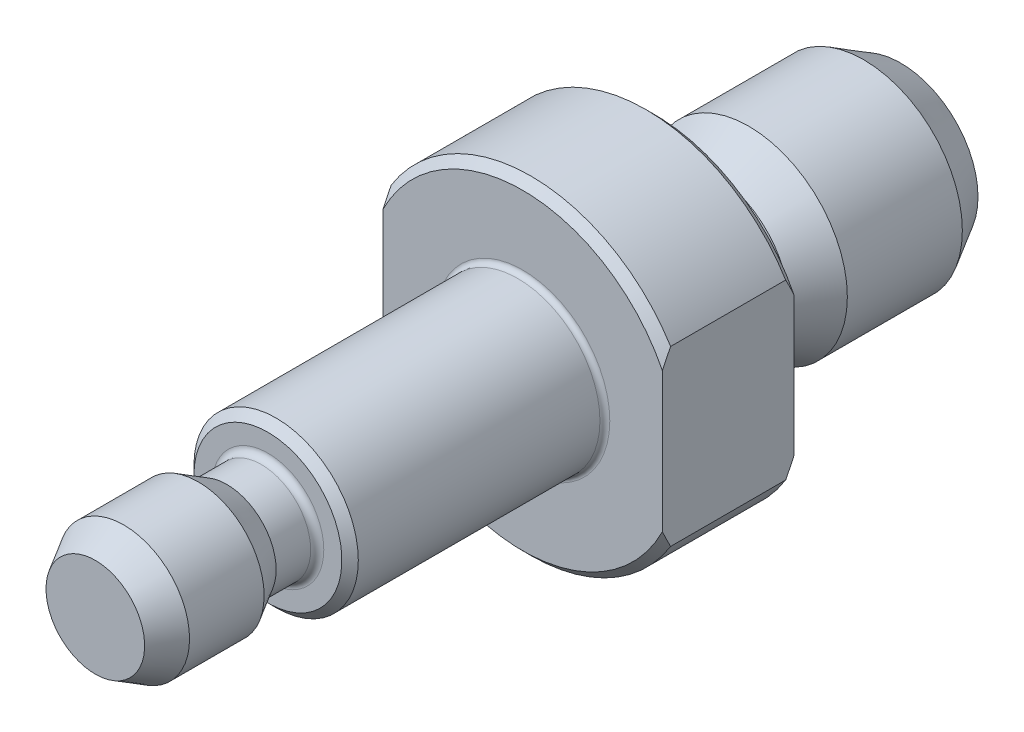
ISO-10303-21;
HEADER;
FILE_DESCRIPTION(('STEP AP214'),'2;1');
FILE_NAME('part.step','',(''),(''),'','','');
FILE_SCHEMA(('AUTOMOTIVE_DESIGN { 1 0 10303 214 1 1 1 1 }'));
ENDSEC;
DATA;
#1=APPLICATION_CONTEXT('core data for automotive mechanical design processes');
#2=APPLICATION_PROTOCOL_DEFINITION('international standard','automotive_design',2000,#1);
#3=PRODUCT_CONTEXT('',#1,'mechanical');
#4=PRODUCT('Part','Part','',(#3));
#5=PRODUCT_RELATED_PRODUCT_CATEGORY('part','',(#4));
#6=PRODUCT_DEFINITION_FORMATION('','',#4);
#7=PRODUCT_DEFINITION_CONTEXT('part definition',#1,'design');
#8=PRODUCT_DEFINITION('design','',#6,#7);
#9=PRODUCT_DEFINITION_SHAPE('','',#8);
#10=(LENGTH_UNIT() NAMED_UNIT(*) SI_UNIT(.MILLI.,.METRE.));
#11=(NAMED_UNIT(*) PLANE_ANGLE_UNIT() SI_UNIT($,.RADIAN.));
#12=(NAMED_UNIT(*) SI_UNIT($,.STERADIAN.) SOLID_ANGLE_UNIT());
#13=UNCERTAINTY_MEASURE_WITH_UNIT(LENGTH_MEASURE(1.E-05),#10,'distance_accuracy_value','');
#14=(GEOMETRIC_REPRESENTATION_CONTEXT(3) GLOBAL_UNCERTAINTY_ASSIGNED_CONTEXT((#13)) GLOBAL_UNIT_ASSIGNED_CONTEXT((#10,
#11,#12)) REPRESENTATION_CONTEXT('',''));
#15=CARTESIAN_POINT('',(0.,0.,0.));
#16=DIRECTION('',(0.,0.,1.));
#17=DIRECTION('',(1.,0.,0.));
#18=AXIS2_PLACEMENT_3D('',#15,#16,#17);
#19=CARTESIAN_POINT('',(0.,0.,0.));
#20=DIRECTION('',(0.,3.37957588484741E-11,1.));
#21=DIRECTION('',(1.,0.,0.));
#22=AXIS2_PLACEMENT_3D('',#19,#20,#21);
#23=CONICAL_SURFACE('',#22,9.5,0.785398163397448);
#24=CARTESIAN_POINT('',(8.5,-5.26782687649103,0.500000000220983));
#25=CARTESIAN_POINT('',(8.5,-5.18370592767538,0.455687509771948));
#26=CARTESIAN_POINT('',(8.5,-5.09926830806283,0.411973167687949));
#27=CARTESIAN_POINT('',(8.5,-4.92976096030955,0.325844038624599));
#28=CARTESIAN_POINT('',(8.5,-4.84469140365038,0.283428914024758));
#29=CARTESIAN_POINT('',(8.5,-4.67387549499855,0.199977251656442));
#30=CARTESIAN_POINT('',(8.5,-4.58812912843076,0.158940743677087));
#31=CARTESIAN_POINT('',(8.5,-4.41592077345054,0.0783385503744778));
#32=CARTESIAN_POINT('',(8.5,-4.32945860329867,0.0387732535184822));
#33=CARTESIAN_POINT('',(8.5,-4.24264068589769,-4.02164412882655E-10));
#34=B_SPLINE_CURVE_WITH_KNOTS('',3,(#24,#25,#26,#27,#28,#29,#30,#31,#32,#33),.UNSPECIFIED.,.F.,
.F.,(4,2,2,2,4),(0.,0.285235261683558,0.570395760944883,0.855562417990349,1.14080384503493),.UNSPECIFIED.);
#35=CARTESIAN_POINT('',(8.5,-5.26782687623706,0.500000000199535));
#36=VERTEX_POINT('',#35);
#37=CARTESIAN_POINT('',(8.5,-4.24264068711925,1.43385303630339E-10));
#38=VERTEX_POINT('',#37);
#39=EDGE_CURVE('E110',#36,#38,#34,.T.);
#40=ORIENTED_EDGE('',*,*,#39,.F.);
#41=CARTESIAN_POINT('',(0.,1.68978794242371E-11,0.5));
#42=DIRECTION('',(0.,3.37957588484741E-11,1.));
#43=DIRECTION('',(1.,0.,0.));
#44=AXIS2_PLACEMENT_3D('',#41,#42,#43);
#45=CIRCLE('',#44,10.);
#46=CARTESIAN_POINT('',(-8.5,-5.26782687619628,0.500000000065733));
#47=VERTEX_POINT('',#46);
#48=EDGE_CURVE('E95',#47,#36,#45,.T.);
#49=ORIENTED_EDGE('',*,*,#48,.F.);
#50=CARTESIAN_POINT('',(-8.5,-4.24264068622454,-2.56211718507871E-10));
#51=CARTESIAN_POINT('',(-8.5,-4.32945860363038,0.0387732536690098));
#52=CARTESIAN_POINT('',(-8.5,-4.41592077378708,0.0783385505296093));
#53=CARTESIAN_POINT('',(-8.5,-4.58812912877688,0.158940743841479));
#54=CARTESIAN_POINT('',(-8.5,-4.67387549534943,0.199977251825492));
#55=CARTESIAN_POINT('',(-8.5,-4.84469140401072,0.283428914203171));
#56=CARTESIAN_POINT('',(-8.5,-4.92976096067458,0.325844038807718));
#57=CARTESIAN_POINT('',(-8.5,-5.09926830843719,0.411973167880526));
#58=CARTESIAN_POINT('',(-8.5,-5.18370592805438,0.455687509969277));
#59=CARTESIAN_POINT('',(-8.5,-5.26782687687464,0.500000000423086));
#60=B_SPLINE_CURVE_WITH_KNOTS('',3,(#50,#51,#52,#53,#54,#55,#56,#57,#58,#59),.UNSPECIFIED.,.F.,
.F.,(4,2,2,2,4),(0.,0.285241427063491,0.570408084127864,0.855568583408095,1.14080384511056),.UNSPECIFIED.);
#61=CARTESIAN_POINT('',(-8.5,-4.24264068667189,-5.64132074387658E-11));
#62=VERTEX_POINT('',#61);
#63=EDGE_CURVE('E81',#62,#47,#60,.T.);
#64=ORIENTED_EDGE('',*,*,#63,.F.);
#65=CARTESIAN_POINT('',(0.,0.,0.));
#66=DIRECTION('',(0.,3.37957588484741E-11,1.));
#67=DIRECTION('',(1.,0.,0.));
#68=AXIS2_PLACEMENT_3D('',#65,#66,#67);
#69=CIRCLE('',#68,9.5);
#70=EDGE_CURVE('E92',#62,#38,#69,.T.);
#71=ORIENTED_EDGE('',*,*,#70,.T.);
#72=EDGE_LOOP('',(#40,#49,#64,#71));
#73=FACE_BOUND('',#72,.T.);
#74=ADVANCED_FACE('F14',(#73),#23,.T.);
#75=CARTESIAN_POINT('',(0.,1.68978794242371E-11,0.5));
#76=DIRECTION('',(0.,3.37957588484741E-11,1.));
#77=DIRECTION('',(1.,0.,0.));
#78=AXIS2_PLACEMENT_3D('',#75,#76,#77);
#79=CYLINDRICAL_SURFACE('',#78,10.);
#80=DIRECTION('',(0.,-3.37957588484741E-11,-1.));
#81=VECTOR('',#80,1.);
#82=CARTESIAN_POINT('',(8.5,-5.26782687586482,4.00000000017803));
#83=LINE('',#82,#81);
#84=CARTESIAN_POINT('',(8.49999999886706,-5.26782687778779,7.50000000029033));
#85=VERTEX_POINT('',#84);
#86=EDGE_CURVE('E148',#85,#36,#83,.T.);
#87=ORIENTED_EDGE('',*,*,#86,.F.);
#88=CARTESIAN_POINT('',(0.,2.53468191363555E-10,7.5));
#89=DIRECTION('',(0.,-3.37957588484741E-11,-1.));
#90=DIRECTION('',(-1.,0.,0.));
#91=AXIS2_PLACEMENT_3D('',#88,#89,#90);
#92=CIRCLE('',#91,10.);
#93=CARTESIAN_POINT('',(-8.5,-5.26782687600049,7.50000000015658));
#94=VERTEX_POINT('',#93);
#95=EDGE_CURVE('E207',#94,#85,#92,.F.);
#96=ORIENTED_EDGE('',*,*,#95,.F.);
#97=DIRECTION('',(0.,3.37957588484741E-11,1.));
#98=VECTOR('',#97,1.);
#99=CARTESIAN_POINT('',(-8.5,-5.26782687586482,4.00000000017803));
#100=LINE('',#99,#98);
#101=EDGE_CURVE('E97',#47,#94,#100,.T.);
#102=ORIENTED_EDGE('',*,*,#101,.F.);
#103=ORIENTED_EDGE('',*,*,#48,.T.);
#104=EDGE_LOOP('',(#87,#96,#102,#103));
#105=FACE_BOUND('',#104,.T.);
#106=ADVANCED_FACE('F243',(#105),#79,.T.);
#107=CARTESIAN_POINT('',(0.,1.68978794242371E-11,0.5));
#108=DIRECTION('',(0.,3.37957588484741E-11,1.));
#109=DIRECTION('',(1.,0.,0.));
#110=AXIS2_PLACEMENT_3D('',#107,#108,#109);
#111=CYLINDRICAL_SURFACE('',#110,10.);
#112=DIRECTION('',(0.,3.37957588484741E-11,1.));
#113=VECTOR('',#112,1.);
#114=CARTESIAN_POINT('',(8.5,5.26782687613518,3.99999999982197));
#115=LINE('',#114,#113);
#116=CARTESIAN_POINT('',(8.5,5.26782687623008,0.499999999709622));
#117=VERTEX_POINT('',#116);
#118=CARTESIAN_POINT('',(8.5,5.26782687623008,7.50000000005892));
#119=VERTEX_POINT('',#118);
#120=EDGE_CURVE('E149',#117,#119,#115,.T.);
#121=ORIENTED_EDGE('',*,*,#120,.F.);
#122=CARTESIAN_POINT('',(0.,1.68978794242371E-11,0.5));
#123=DIRECTION('',(0.,3.37957588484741E-11,1.));
#124=DIRECTION('',(1.,0.,0.));
#125=AXIS2_PLACEMENT_3D('',#122,#123,#124);
#126=CIRCLE('',#125,10.);
#127=CARTESIAN_POINT('',(-8.5,5.26782687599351,0.49999999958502));
#128=VERTEX_POINT('',#127);
#129=EDGE_CURVE('E105',#128,#117,#126,.F.);
#130=ORIENTED_EDGE('',*,*,#129,.F.);
#131=DIRECTION('',(0.,-3.37957588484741E-11,-1.));
#132=VECTOR('',#131,1.);
#133=CARTESIAN_POINT('',(-8.5,5.26782687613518,3.99999999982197));
#134=LINE('',#133,#132);
#135=CARTESIAN_POINT('',(-8.5,5.26782687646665,7.49999999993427));
#136=VERTEX_POINT('',#135);
#137=EDGE_CURVE('E173',#136,#128,#134,.T.);
#138=ORIENTED_EDGE('',*,*,#137,.F.);
#139=CARTESIAN_POINT('',(0.,2.53468191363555E-10,7.5));
#140=DIRECTION('',(0.,-3.37957588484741E-11,-1.));
#141=DIRECTION('',(-1.,0.,0.));
#142=AXIS2_PLACEMENT_3D('',#139,#140,#141);
#143=CIRCLE('',#142,10.);
#144=EDGE_CURVE('E106',#119,#136,#143,.F.);
#145=ORIENTED_EDGE('',*,*,#144,.F.);
#146=EDGE_LOOP('',(#121,#130,#138,#145));
#147=FACE_BOUND('',#146,.T.);
#148=ADVANCED_FACE('F317',(#147),#111,.T.);
#149=CARTESIAN_POINT('',(0.,0.,0.));
#150=DIRECTION('',(0.,3.37957588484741E-11,1.));
#151=DIRECTION('',(1.,0.,0.));
#152=AXIS2_PLACEMENT_3D('',#149,#150,#151);
#153=CONICAL_SURFACE('',#152,9.5,0.785398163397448);
#154=CARTESIAN_POINT('',(8.49999999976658,4.242640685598,-7.01536051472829E-10));
#155=CARTESIAN_POINT('',(8.49999999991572,4.32945860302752,0.038773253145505));
#156=CARTESIAN_POINT('',(8.49999999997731,4.41592077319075,0.0783385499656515));
#157=CARTESIAN_POINT('',(8.50000000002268,4.58812912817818,0.158940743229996));
#158=CARTESIAN_POINT('',(8.50000000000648,4.67387549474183,0.199977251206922));
#159=CARTESIAN_POINT('',(8.49999999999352,4.84469140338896,0.2834289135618));
#160=CARTESIAN_POINT('',(8.49999999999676,4.92976096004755,0.325844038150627));
#161=CARTESIAN_POINT('',(8.50000000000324,5.09926830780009,0.411973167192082));
#162=CARTESIAN_POINT('',(8.50000000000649,5.18370592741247,0.455687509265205));
#163=CARTESIAN_POINT('',(8.5,5.2678268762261,0.499999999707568));
#164=B_SPLINE_CURVE_WITH_KNOTS('',3,(#154,#155,#156,#157,#158,#159,#160,#161,#162,#163),
.UNSPECIFIED.,.F.,.F.,(4,2,2,2,4),(0.,0.285241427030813,0.570408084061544,0.855568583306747,
1.14080384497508),.UNSPECIFIED.);
#165=CARTESIAN_POINT('',(8.5,4.24264068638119,-4.73038275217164E-10));
#166=VERTEX_POINT('',#165);
#167=EDGE_CURVE('E118',#166,#117,#164,.T.);
#168=ORIENTED_EDGE('',*,*,#167,.F.);
#169=CARTESIAN_POINT('',(0.,0.,0.));
#170=DIRECTION('',(0.,3.37957588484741E-11,1.));
#171=DIRECTION('',(1.,0.,0.));
#172=AXIS2_PLACEMENT_3D('',#169,#170,#171);
#173=CIRCLE('',#172,9.5);
#174=CARTESIAN_POINT('',(-8.5,4.24264068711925,-1.43385303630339E-10));
#175=VERTEX_POINT('',#174);
#176=EDGE_CURVE('E104',#166,#175,#173,.T.);
#177=ORIENTED_EDGE('',*,*,#176,.T.);
#178=CARTESIAN_POINT('',(-8.50000000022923,5.26782687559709,0.499999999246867));
#179=CARTESIAN_POINT('',(-8.50000000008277,5.18370592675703,0.455687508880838));
#180=CARTESIAN_POINT('',(-8.50000000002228,5.09926830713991,0.411973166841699));
#181=CARTESIAN_POINT('',(-8.49999999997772,4.929760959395,0.325844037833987));
#182=CARTESIAN_POINT('',(-8.49999999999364,4.84469140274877,0.283428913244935));
#183=CARTESIAN_POINT('',(-8.50000000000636,4.67387549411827,0.199977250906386));
#184=CARTESIAN_POINT('',(-8.50000000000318,4.58812912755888,0.158940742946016));
#185=CARTESIAN_POINT('',(-8.49999999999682,4.41592077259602,0.0783385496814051));
#186=CARTESIAN_POINT('',(-8.49999999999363,4.32945860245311,0.0387732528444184));
#187=CARTESIAN_POINT('',(-8.5,4.24264068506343,-1.06153280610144E-09));
#188=B_SPLINE_CURVE_WITH_KNOTS('',3,(#178,#179,#180,#181,#182,#183,#184,#185,#186,#187),
.UNSPECIFIED.,.F.,.F.,(4,2,2,2,4),(0.,0.285235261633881,0.570395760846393,0.855562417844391,
1.14080384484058),.UNSPECIFIED.);
#189=EDGE_CURVE('E84',#128,#175,#188,.T.);
#190=ORIENTED_EDGE('',*,*,#189,.F.);
#191=ORIENTED_EDGE('',*,*,#129,.T.);
#192=EDGE_LOOP('',(#168,#177,#190,#191));
#193=FACE_BOUND('',#192,.T.);
#194=ADVANCED_FACE('F159',(#193),#153,.T.);
#195=CARTESIAN_POINT('',(-8.5,-9.690384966,3.2749497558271E-10));
#196=DIRECTION('',(0.,3.37957588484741E-11,1.));
#197=DIRECTION('',(1.,0.,0.));
#198=AXIS2_PLACEMENT_3D('',#195,#196,#197);
#199=PLANE('',#198);
#200=ORIENTED_EDGE('',*,*,#70,.F.);
#201=DIRECTION('',(0.,-1.,3.37957588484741E-11));
#202=VECTOR('',#201,1.);
#203=CARTESIAN_POINT('',(-8.5,0.,0.));
#204=LINE('',#203,#202);
#205=EDGE_CURVE('E77',#175,#62,#204,.T.);
#206=ORIENTED_EDGE('',*,*,#205,.F.);
#207=ORIENTED_EDGE('',*,*,#176,.F.);
#208=DIRECTION('',(0.,1.,-3.37957588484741E-11));
#209=VECTOR('',#208,1.);
#210=CARTESIAN_POINT('',(8.5,0.,0.));
#211=LINE('',#210,#209);
#212=EDGE_CURVE('E102',#38,#166,#211,.T.);
#213=ORIENTED_EDGE('',*,*,#212,.F.);
#214=EDGE_LOOP('',(#200,#206,#207,#213));
#215=FACE_BOUND('',#214,.T.);
#216=CARTESIAN_POINT('',(0.,0.,3.21060018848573E-10));
#217=DIRECTION('',(0.,0.,1.));
#218=DIRECTION('',(1.,0.,0.));
#219=AXIS2_PLACEMENT_3D('',#216,#217,#218);
#220=CIRCLE('',#219,5.1);
#221=CARTESIAN_POINT('',(5.1,0.,3.21060018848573E-10));
#222=VERTEX_POINT('',#221);
#223=EDGE_CURVE('E293',#222,#222,#220,.T.);
#224=ORIENTED_EDGE('',*,*,#223,.T.);
#225=EDGE_LOOP('',(#224));
#226=FACE_BOUND('',#225,.T.);
#227=ADVANCED_FACE('F100',(#215,#226),#199,.F.);
#228=CARTESIAN_POINT('',(0.,2.70366070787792E-10,8.));
#229=DIRECTION('',(0.,-3.37955762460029E-11,-1.));
#230=DIRECTION('',(0.,1.,-3.37955762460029E-11));
#231=AXIS2_PLACEMENT_3D('',#228,#229,#230);
#232=CONICAL_SURFACE('',#231,9.5,0.785398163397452);
#233=CARTESIAN_POINT('',(8.50000000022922,5.26782687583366,7.50000000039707));
#234=CARTESIAN_POINT('',(8.50000000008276,5.18370592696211,7.54431249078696));
#235=CARTESIAN_POINT('',(8.50000000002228,5.09926830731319,7.58802683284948));
#236=CARTESIAN_POINT('',(8.49999999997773,4.92976095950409,7.6741559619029));
#237=CARTESIAN_POINT('',(8.49999999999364,4.84469140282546,7.71657108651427));
#238=CARTESIAN_POINT('',(8.50000000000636,4.67387549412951,7.80002274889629));
#239=CARTESIAN_POINT('',(8.50000000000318,4.58812912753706,7.84105925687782));
#240=CARTESIAN_POINT('',(8.49999999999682,4.41592077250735,7.92166145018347));
#241=CARTESIAN_POINT('',(8.49999999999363,4.32945860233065,7.96122674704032));
#242=CARTESIAN_POINT('',(8.5,4.24264068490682,8.00000000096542));
#243=B_SPLINE_CURVE_WITH_KNOTS('',3,(#233,#234,#235,#236,#237,#238,#239,#240,#241,#242),
.UNSPECIFIED.,.F.,.F.,(4,2,2,2,4),(0.,0.285235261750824,0.570395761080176,0.855562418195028,
1.14080384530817),.UNSPECIFIED.);
#244=CARTESIAN_POINT('',(8.5,4.24264068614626,8.00000000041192));
#245=VERTEX_POINT('',#244);
#246=EDGE_CURVE('E141',#119,#245,#243,.T.);
#247=ORIENTED_EDGE('',*,*,#246,.F.);
#248=ORIENTED_EDGE('',*,*,#144,.T.);
#249=CARTESIAN_POINT('',(-8.49999999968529,4.24264068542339,8.00000000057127));
#250=CARTESIAN_POINT('',(-8.49999999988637,4.32945860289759,7.96122674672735));
#251=CARTESIAN_POINT('',(-8.49999999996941,4.41592077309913,7.92166144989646));
#252=CARTESIAN_POINT('',(-8.50000000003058,4.588129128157,7.84105925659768));
#253=CARTESIAN_POINT('',(-8.50000000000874,4.67387549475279,7.80002274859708));
#254=CARTESIAN_POINT('',(-8.49999999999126,4.84469140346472,7.71657108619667));
#255=CARTESIAN_POINT('',(-8.49999999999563,4.92976096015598,7.67415596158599));
#256=CARTESIAN_POINT('',(-8.50000000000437,5.09926830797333,7.58802683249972));
#257=CARTESIAN_POINT('',(-8.50000000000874,5.18370592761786,7.54431249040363));
#258=CARTESIAN_POINT('',(-8.5,5.26782687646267,7.49999999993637));
#259=B_SPLINE_CURVE_WITH_KNOTS('',3,(#249,#250,#251,#252,#253,#254,#255,#256,#257,#258),
.UNSPECIFIED.,.F.,.F.,(4,2,2,2,4),(0.,0.285241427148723,0.570408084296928,0.855568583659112,
1.14080384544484),.UNSPECIFIED.);
#260=CARTESIAN_POINT('',(-8.5,4.24264068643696,8.00000000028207));
#261=VERTEX_POINT('',#260);
#262=EDGE_CURVE('E166',#261,#136,#259,.T.);
#263=ORIENTED_EDGE('',*,*,#262,.F.);
#264=CARTESIAN_POINT('',(0.,2.70366070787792E-10,8.));
#265=DIRECTION('',(0.,-3.37955762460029E-11,-1.));
#266=DIRECTION('',(0.,1.,-3.37955762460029E-11));
#267=AXIS2_PLACEMENT_3D('',#264,#265,#266);
#268=CIRCLE('',#267,9.5);
#269=EDGE_CURVE('E88',#261,#245,#268,.T.);
#270=ORIENTED_EDGE('',*,*,#269,.T.);
#271=EDGE_LOOP('',(#247,#248,#263,#270));
#272=FACE_BOUND('',#271,.T.);
#273=ADVANCED_FACE('F134',(#272),#232,.T.);
#274=CARTESIAN_POINT('',(8.5,-5.26782687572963,8.00000000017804));
#275=DIRECTION('',(1.,0.,0.));
#276=DIRECTION('',(0.,-3.37957588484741E-11,-1.));
#277=AXIS2_PLACEMENT_3D('',#274,#275,#276);
#278=PLANE('',#277);
#279=CARTESIAN_POINT('',(8.49999999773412,-5.26782687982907,7.50000000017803));
#280=CARTESIAN_POINT('',(8.50000020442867,-5.22460481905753,7.52276838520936));
#281=CARTESIAN_POINT('',(8.50000028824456,-5.18129928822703,7.54537852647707));
#282=CARTESIAN_POINT('',(8.50000031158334,-5.09486871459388,7.59008903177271));
#283=CARTESIAN_POINT('',(8.50000025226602,-5.0517450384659,7.61219203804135));
#284=CARTESIAN_POINT('',(8.50000009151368,-4.96567179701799,7.6558883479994));
#285=CARTESIAN_POINT('',(8.49999999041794,-4.92272358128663,7.67748430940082));
#286=CARTESIAN_POINT('',(8.49999982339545,-4.83699468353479,7.72016648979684));
#287=CARTESIAN_POINT('',(8.49999975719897,-4.79421533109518,7.74125537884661));
#288=CARTESIAN_POINT('',(8.4999997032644,-4.70881735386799,7.78292341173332));
#289=CARTESIAN_POINT('',(8.49999971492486,-4.6662000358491,7.80350523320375));
#290=CARTESIAN_POINT('',(8.49999981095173,-4.58111910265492,7.84415911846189));
#291=CARTESIAN_POINT('',(8.49999989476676,-4.53865676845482,7.8642338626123));
#292=CARTESIAN_POINT('',(8.5000000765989,-4.45387853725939,7.90387361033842));
#293=CARTESIAN_POINT('',(8.500000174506,-4.41156389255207,7.92344129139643));
#294=CARTESIAN_POINT('',(8.50000022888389,-4.32707360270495,7.9620668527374));
#295=CARTESIAN_POINT('',(8.50000018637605,-4.28489917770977,7.9811274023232));
#296=CARTESIAN_POINT('',(8.49999999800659,-4.24264069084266,8.00000000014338));
#297=B_SPLINE_CURVE_WITH_KNOTS('',3,(#279,#280,#281,#282,#283,#284,#285,#286,#287,#288,#289,
#290,#291,#292,#293,#294,#295,#296),.UNSPECIFIED.,.F.,.F.,(4,2,2,2,2,2,2,2,4),(0.,
0.146556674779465,0.291929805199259,0.436144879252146,0.579228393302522,0.721207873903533,
0.86211189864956,1.00197011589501,1.14081326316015),.UNSPECIFIED.);
#298=CARTESIAN_POINT('',(8.4999999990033,-4.24264068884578,8.00000000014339));
#299=VERTEX_POINT('',#298);
#300=EDGE_CURVE('E98',#85,#299,#297,.T.);
#301=ORIENTED_EDGE('',*,*,#300,.F.);
#302=ORIENTED_EDGE('',*,*,#86,.T.);
#303=ORIENTED_EDGE('',*,*,#39,.T.);
#304=ORIENTED_EDGE('',*,*,#212,.T.);
#305=ORIENTED_EDGE('',*,*,#167,.T.);
#306=ORIENTED_EDGE('',*,*,#120,.T.);
#307=ORIENTED_EDGE('',*,*,#246,.T.);
#308=DIRECTION('',(0.,-1.,3.37957588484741E-11));
#309=VECTOR('',#308,1.);
#310=CARTESIAN_POINT('',(8.5,2.70366070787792E-10,8.));
#311=LINE('',#310,#309);
#312=EDGE_CURVE('E192',#245,#299,#311,.T.);
#313=ORIENTED_EDGE('',*,*,#312,.T.);
#314=EDGE_LOOP('',(#301,#302,#303,#304,#305,#306,#307,#313));
#315=FACE_BOUND('',#314,.T.);
#316=ADVANCED_FACE('F128',(#315),#278,.T.);
#317=CARTESIAN_POINT('',(0.,2.70366070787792E-10,8.));
#318=DIRECTION('',(0.,-3.37955762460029E-11,-1.));
#319=DIRECTION('',(0.,1.,-3.37955762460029E-11));
#320=AXIS2_PLACEMENT_3D('',#317,#318,#319);
#321=CONICAL_SURFACE('',#320,9.5,0.785398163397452);
#322=ORIENTED_EDGE('',*,*,#300,.T.);
#323=CARTESIAN_POINT('',(0.,2.70366070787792E-10,8.));
#324=DIRECTION('',(0.,-3.37955762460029E-11,-1.));
#325=DIRECTION('',(0.,1.,-3.37955762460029E-11));
#326=AXIS2_PLACEMENT_3D('',#323,#324,#325);
#327=CIRCLE('',#326,9.5);
#328=CARTESIAN_POINT('',(-8.5,-4.24264068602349,8.00000000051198));
#329=VERTEX_POINT('',#328);
#330=EDGE_CURVE('E38',#299,#329,#327,.T.);
#331=ORIENTED_EDGE('',*,*,#330,.T.);
#332=CARTESIAN_POINT('',(-8.5,-5.26782687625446,7.50000000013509));
#333=CARTESIAN_POINT('',(-8.5,-5.18370592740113,7.5443124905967));
#334=CARTESIAN_POINT('',(-8.5,-5.0992683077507,7.58802683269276));
#335=CARTESIAN_POINT('',(-8.5,-4.92976095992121,7.67415596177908));
#336=CARTESIAN_POINT('',(-8.5,-4.84469140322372,7.71657108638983));
#337=CARTESIAN_POINT('',(-8.5,-4.67387549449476,7.8000227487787));
#338=CARTESIAN_POINT('',(-8.5,-4.58812912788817,7.84105925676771));
#339=CARTESIAN_POINT('',(-8.5,-4.41592077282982,7.92166145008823));
#340=CARTESIAN_POINT('',(-8.5,-4.32945860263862,7.96122674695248));
#341=CARTESIAN_POINT('',(-8.5,-4.24264068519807,8.00000000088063));
#342=B_SPLINE_CURVE_WITH_KNOTS('',3,(#332,#333,#334,#335,#336,#337,#338,#339,#340,#341),
.UNSPECIFIED.,.F.,.F.,(4,2,2,2,4),(0.,0.285235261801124,0.570395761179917,0.855562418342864,
1.14080384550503),.UNSPECIFIED.);
#343=EDGE_CURVE('E174',#94,#329,#342,.T.);
#344=ORIENTED_EDGE('',*,*,#343,.F.);
#345=ORIENTED_EDGE('',*,*,#95,.T.);
#346=EDGE_LOOP('',(#322,#331,#344,#345));
#347=FACE_BOUND('',#346,.T.);
#348=ADVANCED_FACE('F133',(#347),#321,.T.);
#349=CARTESIAN_POINT('',(-8.5,-5.267826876,1.78031200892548E-10));
#350=DIRECTION('',(-1.,0.,0.));
#351=DIRECTION('',(0.,3.37957588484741E-11,1.));
#352=AXIS2_PLACEMENT_3D('',#349,#350,#351);
#353=PLANE('',#352);
#354=ORIENTED_EDGE('',*,*,#189,.T.);
#355=ORIENTED_EDGE('',*,*,#205,.T.);
#356=ORIENTED_EDGE('',*,*,#63,.T.);
#357=ORIENTED_EDGE('',*,*,#101,.T.);
#358=ORIENTED_EDGE('',*,*,#343,.T.);
#359=DIRECTION('',(0.,1.,-3.37957588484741E-11));
#360=VECTOR('',#359,1.);
#361=CARTESIAN_POINT('',(-8.5,2.70366070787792E-10,8.));
#362=LINE('',#361,#360);
#363=EDGE_CURVE('E189',#329,#261,#362,.T.);
#364=ORIENTED_EDGE('',*,*,#363,.T.);
#365=ORIENTED_EDGE('',*,*,#262,.T.);
#366=ORIENTED_EDGE('',*,*,#137,.T.);
#367=EDGE_LOOP('',(#354,#355,#356,#357,#358,#364,#365,#366));
#368=FACE_BOUND('',#367,.T.);
#369=ADVANCED_FACE('F79',(#368),#353,.T.);
#370=CARTESIAN_POINT('',(8.5,-9.69038496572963,8.0000000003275));
#371=DIRECTION('',(0.,-3.37957588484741E-11,-1.));
#372=DIRECTION('',(-1.,0.,0.));
#373=AXIS2_PLACEMENT_3D('',#370,#371,#372);
#374=PLANE('',#373);
#375=CARTESIAN_POINT('',(0.,2.70366070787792E-10,8.));
#376=DIRECTION('',(0.,3.37957588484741E-11,1.));
#377=DIRECTION('',(1.,0.,0.));
#378=AXIS2_PLACEMENT_3D('',#375,#376,#377);
#379=CIRCLE('',#378,5.3);
#380=CARTESIAN_POINT('',(5.3,2.70366070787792E-10,8.));
#381=VERTEX_POINT('',#380);
#382=EDGE_CURVE('E191',#381,#381,#379,.F.);
#383=ORIENTED_EDGE('',*,*,#382,.T.);
#384=EDGE_LOOP('',(#383));
#385=FACE_BOUND('',#384,.T.);
#386=ORIENTED_EDGE('',*,*,#330,.F.);
#387=ORIENTED_EDGE('',*,*,#312,.F.);
#388=ORIENTED_EDGE('',*,*,#269,.F.);
#389=ORIENTED_EDGE('',*,*,#363,.F.);
#390=EDGE_LOOP('',(#386,#387,#388,#389));
#391=FACE_BOUND('',#390,.T.);
#392=ADVANCED_FACE('F235',(#385,#391),#374,.F.);
#393=CARTESIAN_POINT('',(0.,2.80504798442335E-10,8.3));
#394=DIRECTION('',(0.,3.37957588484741E-11,1.));
#395=DIRECTION('',(1.,0.,0.));
#396=AXIS2_PLACEMENT_3D('',#393,#394,#395);
#397=TOROIDAL_SURFACE('',#396,5.3,0.300000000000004);
#398=ORIENTED_EDGE('',*,*,#382,.F.);
#399=EDGE_LOOP('',(#398));
#400=FACE_BOUND('',#399,.T.);
#401=CARTESIAN_POINT('',(0.,2.80504798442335E-10,8.3));
#402=DIRECTION('',(0.,3.37957588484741E-11,1.));
#403=DIRECTION('',(1.,0.,0.));
#404=AXIS2_PLACEMENT_3D('',#401,#402,#403);
#405=CIRCLE('',#404,5.);
#406=CARTESIAN_POINT('',(5.,2.80504798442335E-10,8.3));
#407=VERTEX_POINT('',#406);
#408=EDGE_CURVE('E202',#407,#407,#405,.T.);
#409=ORIENTED_EDGE('',*,*,#408,.F.);
#410=EDGE_LOOP('',(#409));
#411=FACE_BOUND('',#410,.T.);
#412=ADVANCED_FACE('F357',(#400,#411),#397,.F.);
#413=CARTESIAN_POINT('',(0.,2.80504798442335E-10,8.3));
#414=DIRECTION('',(0.,3.37957588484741E-11,1.));
#415=DIRECTION('',(1.,0.,0.));
#416=AXIS2_PLACEMENT_3D('',#413,#414,#415);
#417=CYLINDRICAL_SURFACE('',#416,5.);
#418=ORIENTED_EDGE('',*,*,#408,.T.);
#419=EDGE_LOOP('',(#418));
#420=FACE_BOUND('',#419,.T.);
#421=CARTESIAN_POINT('',(0.,7.77302453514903E-10,23.));
#422=DIRECTION('',(0.,-3.37957588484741E-11,-1.));
#423=DIRECTION('',(-1.,0.,0.));
#424=AXIS2_PLACEMENT_3D('',#421,#422,#423);
#425=CIRCLE('',#424,5.);
#426=CARTESIAN_POINT('',(-5.,7.77302453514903E-10,23.));
#427=VERTEX_POINT('',#426);
#428=EDGE_CURVE('E198',#427,#427,#425,.F.);
#429=ORIENTED_EDGE('',*,*,#428,.F.);
#430=EDGE_LOOP('',(#429));
#431=FACE_BOUND('',#430,.T.);
#432=ADVANCED_FACE('F367',(#420,#431),#417,.T.);
#433=CARTESIAN_POINT('',(0.,7.9420033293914E-10,23.5));
#434=DIRECTION('',(0.,-3.37957588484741E-11,-1.));
#435=DIRECTION('',(-1.,0.,0.));
#436=AXIS2_PLACEMENT_3D('',#433,#434,#435);
#437=CONICAL_SURFACE('',#436,4.5,0.785398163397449);
#438=CARTESIAN_POINT('',(0.,7.9420033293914E-10,23.5));
#439=DIRECTION('',(0.,-3.37957588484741E-11,-1.));
#440=DIRECTION('',(-1.,0.,0.));
#441=AXIS2_PLACEMENT_3D('',#438,#439,#440);
#442=CIRCLE('',#441,4.49999999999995);
#443=CARTESIAN_POINT('',(-4.49999999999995,7.9420033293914E-10,23.5));
#444=VERTEX_POINT('',#443);
#445=EDGE_CURVE('E201',#444,#444,#442,.T.);
#446=ORIENTED_EDGE('',*,*,#445,.T.);
#447=EDGE_LOOP('',(#446));
#448=FACE_BOUND('',#447,.T.);
#449=ORIENTED_EDGE('',*,*,#428,.T.);
#450=EDGE_LOOP('',(#449));
#451=FACE_BOUND('',#450,.T.);
#452=ADVANCED_FACE('F268',(#448,#451),#437,.T.);
#453=CARTESIAN_POINT('',(4.554,-4.5696701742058,23.5000000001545));
#454=DIRECTION('',(0.,-3.37957588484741E-11,-1.));
#455=DIRECTION('',(-1.,0.,0.));
#456=AXIS2_PLACEMENT_3D('',#453,#454,#455);
#457=PLANE('',#456);
#458=CARTESIAN_POINT('',(0.,7.9420033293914E-10,23.5));
#459=DIRECTION('',(0.,3.37957588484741E-11,1.));
#460=DIRECTION('',(1.,0.,0.));
#461=AXIS2_PLACEMENT_3D('',#458,#459,#460);
#462=CIRCLE('',#461,3.4);
#463=CARTESIAN_POINT('',(3.4,7.9420033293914E-10,23.5));
#464=VERTEX_POINT('',#463);
#465=EDGE_CURVE('E197',#464,#464,#462,.F.);
#466=ORIENTED_EDGE('',*,*,#465,.T.);
#467=EDGE_LOOP('',(#466));
#468=FACE_BOUND('',#467,.T.);
#469=ORIENTED_EDGE('',*,*,#445,.F.);
#470=EDGE_LOOP('',(#469));
#471=FACE_BOUND('',#470,.T.);
#472=ADVANCED_FACE('F263',(#468,#471),#457,.F.);
#473=CARTESIAN_POINT('',(0.,8.0771863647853E-10,23.9));
#474=DIRECTION('',(0.,3.37957588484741E-11,1.));
#475=DIRECTION('',(1.,0.,0.));
#476=AXIS2_PLACEMENT_3D('',#473,#474,#475);
#477=TOROIDAL_SURFACE('',#476,3.4,0.4);
#478=CARTESIAN_POINT('',(0.,8.0771863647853E-10,23.9));
#479=DIRECTION('',(0.,3.37957588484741E-11,1.));
#480=DIRECTION('',(1.,0.,0.));
#481=AXIS2_PLACEMENT_3D('',#478,#479,#480);
#482=CIRCLE('',#481,3.);
#483=CARTESIAN_POINT('',(3.,8.0771863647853E-10,23.9));
#484=VERTEX_POINT('',#483);
#485=EDGE_CURVE('E194',#484,#484,#482,.T.);
#486=ORIENTED_EDGE('',*,*,#485,.F.);
#487=EDGE_LOOP('',(#486));
#488=FACE_BOUND('',#487,.T.);
#489=ORIENTED_EDGE('',*,*,#465,.F.);
#490=EDGE_LOOP('',(#489));
#491=FACE_BOUND('',#490,.T.);
#492=ADVANCED_FACE('F254',(#488,#491),#477,.F.);
#493=CARTESIAN_POINT('',(0.,8.0771863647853E-10,23.9));
#494=DIRECTION('',(0.,3.37954697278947E-11,1.));
#495=DIRECTION('',(0.,-1.,3.37954697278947E-11));
#496=AXIS2_PLACEMENT_3D('',#493,#494,#495);
#497=CYLINDRICAL_SURFACE('',#496,3.);
#498=CARTESIAN_POINT('',(0.,0.,25.9999999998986));
#499=DIRECTION('',(0.,0.,1.));
#500=DIRECTION('',(1.,0.,0.));
#501=AXIS2_PLACEMENT_3D('',#498,#499,#500);
#502=CIRCLE('',#501,3.00000000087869);
#503=CARTESIAN_POINT('',(3.00000000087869,0.,25.9999999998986));
#504=VERTEX_POINT('',#503);
#505=EDGE_CURVE('E309',#504,#504,#502,.T.);
#506=ORIENTED_EDGE('',*,*,#505,.F.);
#507=EDGE_LOOP('',(#506));
#508=FACE_BOUND('',#507,.T.);
#509=ORIENTED_EDGE('',*,*,#485,.T.);
#510=EDGE_LOOP('',(#509));
#511=FACE_BOUND('',#510,.T.);
#512=ADVANCED_FACE('F251',(#508,#511),#497,.T.);
#513=CARTESIAN_POINT('',(0.,0.,30.5507543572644));
#514=DIRECTION('',(0.,0.,1.));
#515=DIRECTION('',(1.,0.,0.));
#516=AXIS2_PLACEMENT_3D('',#513,#514,#515);
#517=CONICAL_SURFACE('',#516,5.62737925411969,0.523598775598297);
#518=ORIENTED_EDGE('',*,*,#505,.T.);
#519=EDGE_LOOP('',(#518));
#520=FACE_BOUND('',#519,.T.);
#521=CARTESIAN_POINT('',(-2.60316549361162,-3.03702640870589,27.7320508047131));
#522=CARTESIAN_POINT('',(-2.77499153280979,-2.8897332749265,27.7320508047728));
#523=CARTESIAN_POINT('',(-2.93441875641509,-2.72771096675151,27.7320508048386));
#524=CARTESIAN_POINT('',(-3.22370969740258,-2.37889790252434,27.7320508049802));
#525=CARTESIAN_POINT('',(-3.3535366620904,-2.19207680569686,27.732050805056));
#526=CARTESIAN_POINT('',(-3.57885057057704,-1.80066794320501,27.7320508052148));
#527=CARTESIAN_POINT('',(-3.67459484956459,-1.59622844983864,27.7320508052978));
#528=CARTESIAN_POINT('',(-3.83037146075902,-1.17423733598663,27.7320508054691));
#529=CARTESIAN_POINT('',(-3.89041370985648,-0.956689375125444,27.7320508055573));
#530=CARTESIAN_POINT('',(-3.97313393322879,-0.514574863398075,27.7320508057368));
#531=CARTESIAN_POINT('',(-3.99580755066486,-0.290007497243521,27.7320508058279));
#532=CARTESIAN_POINT('',(-4.00313204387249,0.159756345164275,27.7320508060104));
#533=CARTESIAN_POINT('',(-3.98778121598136,0.384952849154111,27.7320508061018));
#534=CARTESIAN_POINT('',(-3.91949014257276,0.829567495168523,27.7320508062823));
#535=CARTESIAN_POINT('',(-3.86655068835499,1.04898575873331,27.7320508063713));
#536=CARTESIAN_POINT('',(-3.72458611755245,1.47581958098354,27.7320508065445));
#537=CARTESIAN_POINT('',(-3.63556109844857,1.68323517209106,27.7320508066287));
#538=CARTESIAN_POINT('',(-3.42395233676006,2.08017685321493,27.7320508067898));
#539=CARTESIAN_POINT('',(-3.30136851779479,2.26970290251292,27.7320508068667));
#540=CARTESIAN_POINT('',(-3.02612229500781,2.62548453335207,27.7320508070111));
#541=CARTESIAN_POINT('',(-2.87345994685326,2.79174015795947,27.7320508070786));
#542=CARTESIAN_POINT('',(-2.54239009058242,3.09626191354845,27.7320508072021));
#543=CARTESIAN_POINT('',(-2.36398257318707,3.23452803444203,27.7320508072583));
#544=CARTESIAN_POINT('',(-1.98648666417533,3.47914588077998,27.7320508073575));
#545=CARTESIAN_POINT('',(-1.7873982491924,3.58549757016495,27.7320508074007));
#546=CARTESIAN_POINT('',(-1.37419232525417,3.76326729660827,27.7320508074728));
#547=CARTESIAN_POINT('',(-1.16007482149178,3.83468534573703,27.7320508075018));
#548=CARTESIAN_POINT('',(-0.722888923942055,3.9405604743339,27.7320508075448));
#549=CARTESIAN_POINT('',(-0.499820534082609,3.97501757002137,27.7320508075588));
#550=CARTESIAN_POINT('',(-0.0510649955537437,4.00599271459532,27.7320508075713));
#551=CARTESIAN_POINT('',(0.174622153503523,4.00251075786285,27.7320508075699));
#552=CARTESIAN_POINT('',(0.62220861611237,3.95770662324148,27.7320508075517));
#553=CARTESIAN_POINT('',(0.844107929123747,3.91638443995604,27.732050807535));
#554=CARTESIAN_POINT('',(1.27781960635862,3.7970728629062,27.7320508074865));
#555=CARTESIAN_POINT('',(1.48963197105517,3.71908347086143,27.7320508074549));
#556=CARTESIAN_POINT('',(1.89715702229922,3.52865137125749,27.7320508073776));
#557=CARTESIAN_POINT('',(2.09286970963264,3.41620866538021,27.732050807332));
#558=CARTESIAN_POINT('',(2.46263971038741,3.16006185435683,27.732050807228));
#559=CARTESIAN_POINT('',(2.63669702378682,3.01635774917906,27.7320508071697));
#560=CARTESIAN_POINT('',(2.95821530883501,2.70176746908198,27.7320508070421));
#561=CARTESIAN_POINT('',(3.10567627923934,2.53088129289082,27.7320508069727));
#562=CARTESIAN_POINT('',(3.36981589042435,2.16677782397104,27.7320508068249));
#563=CARTESIAN_POINT('',(3.48649452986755,1.97356053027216,27.7320508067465));
#564=CARTESIAN_POINT('',(3.68575729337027,1.57027973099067,27.7320508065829));
#565=CARTESIAN_POINT('',(3.76834142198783,1.36021622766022,27.7320508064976));
#566=CARTESIAN_POINT('',(3.8970708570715,0.929206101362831,27.7320508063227));
#567=CARTESIAN_POINT('',(3.94321616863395,0.708259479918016,27.732050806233));
#568=CARTESIAN_POINT('',(3.99775807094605,0.261755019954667,27.7320508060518));
#569=CARTESIAN_POINT('',(4.00615464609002,0.036197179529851,27.7320508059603));
#570=CARTESIAN_POINT('',(3.984960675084,-0.413126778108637,27.7320508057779));
#571=CARTESIAN_POINT('',(3.95537011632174,-0.636892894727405,27.7320508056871));
#572=CARTESIAN_POINT('',(3.85904189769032,-1.07628102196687,27.7320508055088));
#573=CARTESIAN_POINT('',(3.79230427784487,-1.29190304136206,27.7320508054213));
#574=CARTESIAN_POINT('',(3.6235764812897,-1.70888228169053,27.7320508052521));
#575=CARTESIAN_POINT('',(3.52158631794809,-1.91023950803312,27.7320508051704));
#576=CARTESIAN_POINT('',(3.28524840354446,-2.29297367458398,27.732050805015));
#577=CARTESIAN_POINT('',(3.15090059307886,-2.47435057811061,27.7320508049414));
#578=CARTESIAN_POINT('',(2.85366153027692,-2.81197458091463,27.7320508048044));
#579=CARTESIAN_POINT('',(2.69077033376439,-2.96822172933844,27.732050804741));
#580=CARTESIAN_POINT('',(2.34106791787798,-3.25115153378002,27.7320508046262));
#581=CARTESIAN_POINT('',(2.15425664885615,-3.37783412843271,27.7320508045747));
#582=CARTESIAN_POINT('',(1.76201375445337,-3.5980404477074,27.7320508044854));
#583=CARTESIAN_POINT('',(1.55658177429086,-3.69156354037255,27.7320508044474));
#584=CARTESIAN_POINT('',(1.1329403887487,-3.84278915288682,27.7320508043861));
#585=CARTESIAN_POINT('',(0.914731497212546,-3.9004931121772,27.7320508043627));
#586=CARTESIAN_POINT('',(0.471748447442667,-3.97844547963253,27.732050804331));
#587=CARTESIAN_POINT('',(0.246974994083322,-3.99869789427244,27.7320508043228));
#588=CARTESIAN_POINT('',(-0.202844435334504,-4.00118038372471,27.7320508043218));
#589=CARTESIAN_POINT('',(-0.42789046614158,-3.9834007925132,27.732050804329));
#590=CARTESIAN_POINT('',(-0.871891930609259,-3.91030339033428,27.7320508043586));
#591=CARTESIAN_POINT('',(-1.09084433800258,-3.8549672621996,27.7320508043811));
#592=CARTESIAN_POINT('',(-1.51615081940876,-3.70833733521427,27.7320508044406));
#593=CARTESIAN_POINT('',(-1.72252005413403,-3.61708783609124,27.7320508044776));
#594=CARTESIAN_POINT('',(-2.04137514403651,-3.44268651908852,27.7320508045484));
#595=CARTESIAN_POINT('',(-2.15958374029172,-3.36978244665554,27.732050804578));
#596=CARTESIAN_POINT('',(-2.38780379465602,-3.21210684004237,27.732050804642));
#597=CARTESIAN_POINT('',(-2.4978151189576,-3.12733511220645,27.7320508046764));
#598=CARTESIAN_POINT('',(-2.60316549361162,-3.03702640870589,27.7320508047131));
#599=B_SPLINE_CURVE_WITH_KNOTS('',3,(#521,#522,#523,#524,#525,#526,#527,#528,#529,#530,#531,
#532,#533,#534,#535,#536,#537,#538,#539,#540,#541,#542,#543,#544,#545,#546,#547,#548,#549,#550,
#551,#552,#553,#554,#555,#556,#557,#558,#559,#560,#561,#562,#563,#564,#565,#566,#567,#568,#569,
#570,#571,#572,#573,#574,#575,#576,#577,#578,#579,#580,#581,#582,#583,#584,#585,#586,#587,#588,
#589,#590,#591,#592,#593,#594,#595,#596,#597,#598),.UNSPECIFIED.,.T.,.F.,(4,2,2,2,2,2,2,2,2,2,2,
2,2,2,2,2,2,2,2,2,2,2,2,2,2,2,2,2,2,2,2,2,2,2,2,2,2,2,4),(0.,0.678437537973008,1.35771291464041,
2.03174496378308,2.70558970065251,3.37951299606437,4.05346648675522,4.7274057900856,
5.40134327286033,6.07528228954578,6.74922005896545,7.42315807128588,8.09709684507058,
8.77103538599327,9.4449736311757,10.1189119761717,10.7928504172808,11.4667888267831,
12.1407272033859,12.8146655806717,13.4886039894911,14.1625424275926,14.8364807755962,
15.5104190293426,16.1843575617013,16.8582963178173,17.5322343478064,18.2061721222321,
18.8801111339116,19.5540488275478,20.2279879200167,20.901939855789,21.5758647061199,
22.2497174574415,22.9237414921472,23.5980944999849,24.2716182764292,24.6875766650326,
25.1035418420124),.UNSPECIFIED.);
#600=CARTESIAN_POINT('',(-2.60316549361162,-3.03702640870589,27.7320508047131));
#601=VERTEX_POINT('',#600);
#602=EDGE_CURVE('E18',#601,#601,#599,.T.);
#603=ORIENTED_EDGE('',*,*,#602,.T.);
#604=EDGE_LOOP('',(#603));
#605=FACE_BOUND('',#604,.T.);
#606=ADVANCED_FACE('F253',(#520,#605),#517,.T.);
#607=CARTESIAN_POINT('',(3.036,-3.04644678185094,34.000000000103));
#608=DIRECTION('',(0.,-3.37957588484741E-11,-1.));
#609=DIRECTION('',(-1.,0.,0.));
#610=AXIS2_PLACEMENT_3D('',#607,#608,#609);
#611=PLANE('',#610);
#612=CARTESIAN_POINT('',(0.,1.14905580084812E-09,34.));
#613=DIRECTION('',(0.,-3.37957588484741E-11,-1.));
#614=DIRECTION('',(-1.,0.,0.));
#615=AXIS2_PLACEMENT_3D('',#612,#613,#614);
#616=CIRCLE('',#615,3.);
#617=CARTESIAN_POINT('',(-3.,1.14905580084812E-09,34.));
#618=VERTEX_POINT('',#617);
#619=EDGE_CURVE('E29',#618,#618,#616,.T.);
#620=ORIENTED_EDGE('',*,*,#619,.F.);
#621=EDGE_LOOP('',(#620));
#622=FACE_BOUND('',#621,.T.);
#623=ADVANCED_FACE('F16',(#622),#611,.F.);
#624=CARTESIAN_POINT('',(0.,1.14905580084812E-09,34.));
#625=DIRECTION('',(0.,-3.37957588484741E-11,-1.));
#626=DIRECTION('',(-1.,0.,0.));
#627=AXIS2_PLACEMENT_3D('',#624,#625,#626);
#628=CONICAL_SURFACE('',#627,3.,0.523598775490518);
#629=CARTESIAN_POINT('',(0.,1.09051982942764E-09,32.267949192));
#630=DIRECTION('',(0.,-3.37957588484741E-11,-1.));
#631=DIRECTION('',(-1.,0.,0.));
#632=AXIS2_PLACEMENT_3D('',#629,#630,#631);
#633=CIRCLE('',#632,4.);
#634=CARTESIAN_POINT('',(-4.,1.09051982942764E-09,32.267949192));
#635=VERTEX_POINT('',#634);
#636=EDGE_CURVE('E9',#635,#635,#633,.F.);
#637=ORIENTED_EDGE('',*,*,#636,.T.);
#638=EDGE_LOOP('',(#637));
#639=FACE_BOUND('',#638,.T.);
#640=ORIENTED_EDGE('',*,*,#619,.T.);
#641=EDGE_LOOP('',(#640));
#642=FACE_BOUND('',#641,.T.);
#643=ADVANCED_FACE('F274',(#639,#642),#628,.T.);
#644=CARTESIAN_POINT('',(0.,8.78689730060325E-10,26.));
#645=DIRECTION('',(0.,3.37957588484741E-11,1.));
#646=DIRECTION('',(1.,0.,0.));
#647=AXIS2_PLACEMENT_3D('',#644,#645,#646);
#648=CYLINDRICAL_SURFACE('',#647,4.);
#649=ORIENTED_EDGE('',*,*,#636,.F.);
#650=EDGE_LOOP('',(#649));
#651=FACE_BOUND('',#650,.T.);
#652=ORIENTED_EDGE('',*,*,#602,.F.);
#653=EDGE_LOOP('',(#652));
#654=FACE_BOUND('',#653,.T.);
#655=ADVANCED_FACE('F269',(#651,#654),#648,.T.);
#656=CARTESIAN_POINT('',(0.,0.,-5.75166604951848));
#657=DIRECTION('',(0.,0.,-1.));
#658=DIRECTION('',(-1.,0.,0.));
#659=AXIS2_PLACEMENT_3D('',#656,#657,#658);
#660=CONICAL_SURFACE('',#659,6.,0.523598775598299);
#661=CARTESIAN_POINT('',(0.,0.,-3.49999999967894));
#662=DIRECTION('',(0.,0.,1.));
#663=DIRECTION('',(1.,0.,0.));
#664=AXIS2_PLACEMENT_3D('',#661,#662,#663);
#665=CIRCLE('',#664,4.7);
#666=CARTESIAN_POINT('',(4.7,0.,-3.49999999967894));
#667=VERTEX_POINT('',#666);
#668=EDGE_CURVE('E306',#667,#667,#665,.T.);
#669=ORIENTED_EDGE('',*,*,#668,.F.);
#670=EDGE_LOOP('',(#669));
#671=FACE_BOUND('',#670,.T.);
#672=CARTESIAN_POINT('',(0.,0.,-5.75166604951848));
#673=DIRECTION('',(0.,0.,1.));
#674=DIRECTION('',(1.,0.,0.));
#675=AXIS2_PLACEMENT_3D('',#672,#673,#674);
#676=CIRCLE('',#675,6.);
#677=CARTESIAN_POINT('',(6.,0.,-5.75166604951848));
#678=VERTEX_POINT('',#677);
#679=EDGE_CURVE('E300',#678,#678,#676,.T.);
#680=ORIENTED_EDGE('',*,*,#679,.T.);
#681=EDGE_LOOP('',(#680));
#682=FACE_BOUND('',#681,.T.);
#683=ADVANCED_FACE('F273',(#671,#682),#660,.T.);
#684=CARTESIAN_POINT('',(0.,0.,4.03543789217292));
#685=DIRECTION('',(0.,0.,1.));
#686=DIRECTION('',(1.,0.,0.));
#687=AXIS2_PLACEMENT_3D('',#684,#685,#686);
#688=CYLINDRICAL_SURFACE('',#687,4.7);
#689=CARTESIAN_POINT('',(0.,0.,-0.399999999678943));
#690=DIRECTION('',(0.,0.,1.));
#691=DIRECTION('',(1.,0.,0.));
#692=AXIS2_PLACEMENT_3D('',#689,#690,#691);
#693=CIRCLE('',#692,4.7);
#694=CARTESIAN_POINT('',(4.7,0.,-0.399999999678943));
#695=VERTEX_POINT('',#694);
#696=EDGE_CURVE('E297',#695,#695,#693,.T.);
#697=ORIENTED_EDGE('',*,*,#696,.F.);
#698=EDGE_LOOP('',(#697));
#699=FACE_BOUND('',#698,.T.);
#700=ORIENTED_EDGE('',*,*,#668,.T.);
#701=EDGE_LOOP('',(#700));
#702=FACE_BOUND('',#701,.T.);
#703=ADVANCED_FACE('F413',(#699,#702),#688,.T.);
#704=CARTESIAN_POINT('',(0.,0.,-0.399999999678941));
#705=DIRECTION('',(0.,0.,1.));
#706=DIRECTION('',(1.,0.,0.));
#707=AXIS2_PLACEMENT_3D('',#704,#705,#706);
#708=TOROIDAL_SURFACE('',#707,5.1,0.4);
#709=ORIENTED_EDGE('',*,*,#223,.F.);
#710=EDGE_LOOP('',(#709));
#711=FACE_BOUND('',#710,.T.);
#712=ORIENTED_EDGE('',*,*,#696,.T.);
#713=EDGE_LOOP('',(#712));
#714=FACE_BOUND('',#713,.T.);
#715=ADVANCED_FACE('F424',(#711,#714),#708,.F.);
#716=CARTESIAN_POINT('',(0.,-4.30839619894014E-10,-12.74833395));
#717=DIRECTION('',(0.,3.37957588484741E-11,1.));
#718=DIRECTION('',(1.,0.,0.));
#719=AXIS2_PLACEMENT_3D('',#716,#717,#718);
#720=CYLINDRICAL_SURFACE('',#719,6.);
#721=ORIENTED_EDGE('',*,*,#679,.F.);
#722=EDGE_LOOP('',(#721));
#723=FACE_BOUND('',#722,.T.);
#724=CARTESIAN_POINT('',(0.,0.,-12.7483339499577));
#725=DIRECTION('',(0.,0.,1.));
#726=DIRECTION('',(1.,0.,0.));
#727=AXIS2_PLACEMENT_3D('',#724,#725,#726);
#728=CIRCLE('',#727,6.);
#729=CARTESIAN_POINT('',(6.,0.,-12.7483339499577));
#730=VERTEX_POINT('',#729);
#731=EDGE_CURVE('E294',#730,#730,#728,.T.);
#732=ORIENTED_EDGE('',*,*,#731,.T.);
#733=EDGE_LOOP('',(#732));
#734=FACE_BOUND('',#733,.T.);
#735=ADVANCED_FACE('F286',(#723,#734),#720,.T.);
#736=CARTESIAN_POINT('',(0.,0.,-14.9999999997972));
#737=DIRECTION('',(0.,0.,1.));
#738=DIRECTION('',(1.,0.,0.));
#739=AXIS2_PLACEMENT_3D('',#736,#737,#738);
#740=CONICAL_SURFACE('',#739,4.7,0.523598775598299);
#741=ORIENTED_EDGE('',*,*,#731,.F.);
#742=EDGE_LOOP('',(#741));
#743=FACE_BOUND('',#742,.T.);
#744=CARTESIAN_POINT('',(0.,0.,-14.9999999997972));
#745=DIRECTION('',(0.,0.,1.));
#746=DIRECTION('',(1.,0.,0.));
#747=AXIS2_PLACEMENT_3D('',#744,#745,#746);
#748=CIRCLE('',#747,4.7);
#749=CARTESIAN_POINT('',(4.7,0.,-14.9999999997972));
#750=VERTEX_POINT('',#749);
#751=EDGE_CURVE('E291',#750,#750,#748,.T.);
#752=ORIENTED_EDGE('',*,*,#751,.T.);
#753=EDGE_LOOP('',(#752));
#754=FACE_BOUND('',#753,.T.);
#755=ADVANCED_FACE('F280',(#743,#754),#740,.T.);
#756=CARTESIAN_POINT('',(-4.7564,-4.77276662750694,-14.9999999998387));
#757=DIRECTION('',(0.,3.37957588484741E-11,1.));
#758=DIRECTION('',(1.,0.,0.));
#759=AXIS2_PLACEMENT_3D('',#756,#757,#758);
#760=PLANE('',#759);
#761=ORIENTED_EDGE('',*,*,#751,.F.);
#762=EDGE_LOOP('',(#761));
#763=FACE_BOUND('',#762,.T.);
#764=ADVANCED_FACE('F278',(#763),#760,.F.);
#765=CLOSED_SHELL('',(#74,#106,#148,#194,#227,#273,#316,#348,#369,#392,#412,#432,#452,#472,#492,
#512,#606,#623,#643,#655,#683,#703,#715,#735,#755,#764));
#766=MANIFOLD_SOLID_BREP('B1',#765);
#767=ADVANCED_BREP_SHAPE_REPRESENTATION('',(#18,#766),#14);
#768=SHAPE_DEFINITION_REPRESENTATION(#9,#767);
ENDSEC;
END-ISO-10303-21;
